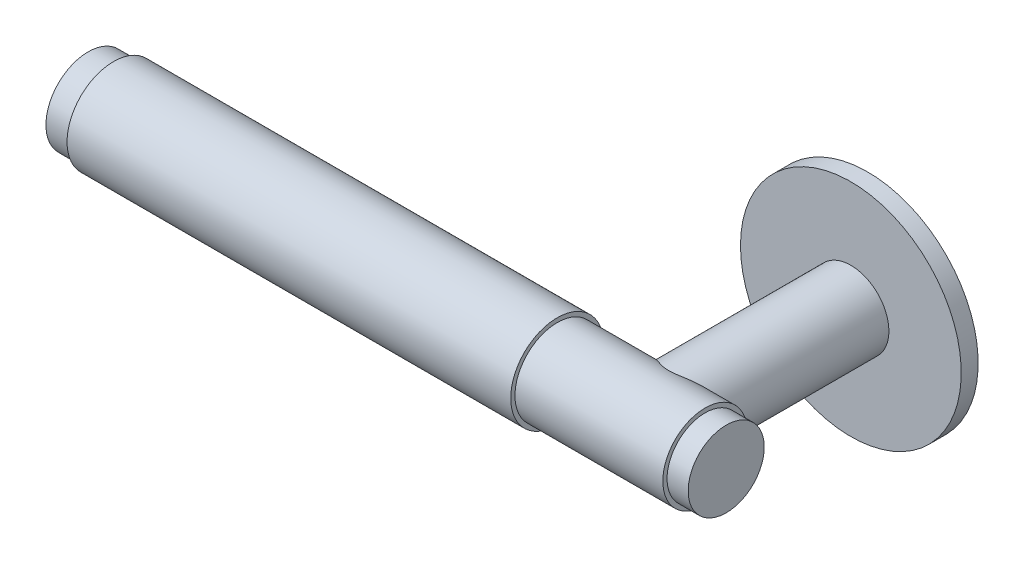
from build123d import *

# Parameters (mm, degrees)
SKETCH2_R             = 9
BOSS_EXTRUDE1_DEPTH   = 47.5
SKETCH3_R             = 26.125
BOSS_EXTRUDE2_DEPTH   = 4
BODY_MOVE_COPY1_ANGLE = 180


with BuildPart() as part:
    # Sketch1 → Revolve1 (revolve)
    with BuildSketch(Plane.XY, mode=Mode.PRIVATE) as revolve1_sk:
        Polygon((-108.862344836, 1.774528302), (42.137655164, 1.774528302), (42.137655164, 11.774528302), (36.137655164, 11.774528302), (36.137655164, 12.774528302), (-68.862344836, 12.774528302), (-68.862344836, 11.774528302), (-103.862344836, 11.774528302), (-103.862344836, 10.774528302), (-108.862344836, 10.774528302), align=None)
    revolve(revolve1_sk.sketch.rotate(Axis((-108.862344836, 1.774528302, 0), (1, 0, 0)), 90), axis=Axis((-108.862344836, 1.774528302, 0), (1, 0, 0)))

    # Sketch2 → Boss-Extrude1 (add)
    with BuildSketch(Plane.XY):
        with Locations((-90.862344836, 1.774528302)):
            Circle(SKETCH2_R)
    extrude(amount=BOSS_EXTRUDE1_DEPTH)

    # Sketch3 → Boss-Extrude2 (add)
    with BuildSketch(Plane.XY.offset(47.5)):
        with Locations((-90.862344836, 1.774528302)):
            Circle(SKETCH3_R)
    extrude(amount=BOSS_EXTRUDE2_DEPTH)


with BuildPart() as part_1:
    # Body-Move_Copy1: moved
    add(part.part.rotate(Axis((-37.424844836, 0, 20.25), (0, 1, 0)), BODY_MOVE_COPY1_ANGLE))


with BuildPart() as part_2:
    # Body-Move_Copy2: moved
    add(part_1.part.moved(Location((0, 0, 11))))


solid = part_2.part
